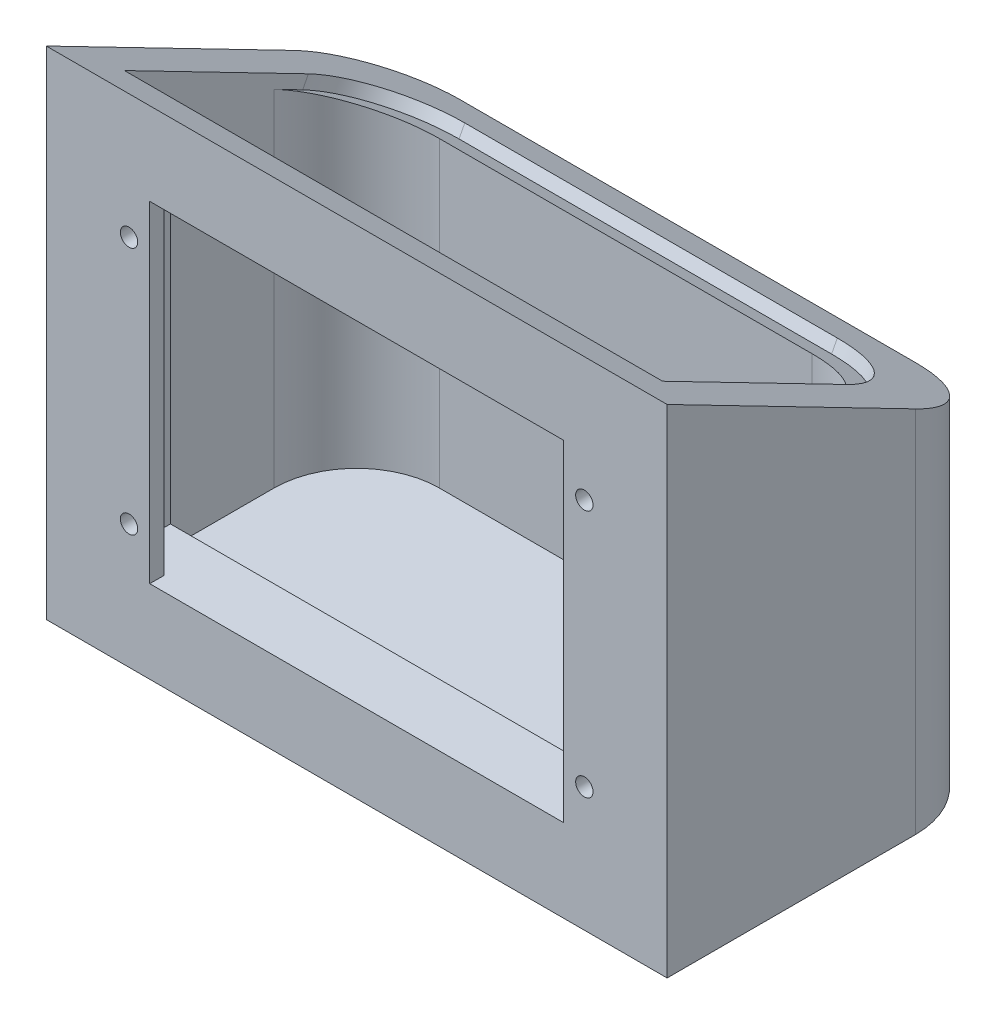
from build123d import *

# Parameters (mm, degrees)
BOSS_EXTRUDE1_DEPTH = 150
CUT_EXTRUDE1_DEPTH  = 3
FILLET1_R           = 20
CUT_EXTRUDE6_REACH  = 220.087
CUT_EXTRUDE6_START  = -10
SKETCH5_W           = 120
SKETCH5_H           = 80
CUT_EXTRUDE7_DEPTH  = 15
SKETCH8_W           = 3.5
SKETCH8_H           = 80
BOSS_EXTRUDE2_DEPTH = 10
SKETCH9_W           = 3.5
SKETCH9_H           = 80
BOSS_EXTRUDE3_DEPTH = 10
SKETCH10_R          = 2.1
CUT_EXTRUDE8_DEPTH  = 3.5


with BuildPart() as part:
    # Sketch1 → Boss-Extrude1 (new body)
    with BuildSketch(Plane(origin=(0, 0, 0), x_dir=(0, 0, -1), z_dir=(1, 0, 0))):
        Polygon((0, 0), (0, 120), (80, 78.768943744), (80, 0), align=None)
    extrude(amount=BOSS_EXTRUDE1_DEPTH)

    # Sketch2 → Cut-Extrude1 (cut)
    with BuildSketch(Plane(origin=(0, 94.814814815, -48.866437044), x_dir=(1, 0, 0), z_dir=(0, 0.8888888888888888, -0.45812284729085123))):
        with BuildLine():
            Line((30, 25.025258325), (120, 25.025258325))
            ThreePointArc((120, 25.025258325), (134.142135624, 19.167393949), (140, 5.025258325))
            Line((140, 5.025258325), (140, -44.974741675))
            Line((140, -44.974741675), (10, -44.974741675))
            Line((10, -44.974741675), (10, 5.025258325))
            ThreePointArc((10, 5.025258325), (15.857864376, 19.167393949), (30, 25.025258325))
        make_face()
    extrude(amount=-CUT_EXTRUDE1_DEPTH, mode=Mode.SUBTRACT)

    # Fillet1
    fillet1_edges = [part.edges().sort_by_distance(p)[0] for p in [
        (0, 39.384471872, -80),
        (150, 39.384471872, -80),
    ]]
    fillet(fillet1_edges, radius=FILLET1_R)

    # Cut-Extrude6: up to this plane
    cut_extrude6_end = Plane(origin=(30, 89.845962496, -51.958964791), z_dir=(0, 0.8888888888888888, -0.45812284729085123))
    # Sketch4 → Cut-Extrude6 (cut, up to the surface)
    with BuildSketch(Plane.XZ.offset(CUT_EXTRUDE6_START), mode=Mode.PRIVATE) as cut_extrude6_sk1:
        with BuildLine():
            Line((140, -15), (140, -45))
            ThreePointArc((140, -45), (134.142135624, -59.142135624), (120, -65))
            Line((120, -65), (30, -65))
            ThreePointArc((30, -65), (15.857864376, -59.142135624), (10, -45))
            Line((10, -45), (10, -15))
            Line((10, -15), (140, -15))
        make_face()
    cut_extrude6_tool1 = split(extrude(cut_extrude6_sk1.sketch, amount=-CUT_EXTRUDE6_REACH, mode=Mode.PRIVATE), bisect_by=cut_extrude6_end, keep=Keep.BOTH, mode=Mode.PRIVATE)
    add(cut_extrude6_tool1.solids().sort_by_distance((75, 10, -39.442968))[0], mode=Mode.SUBTRACT)

    # Sketch5 → Cut-Extrude7 (cut)
    with BuildSketch(Plane.XY):
        with Locations((75, 60)):
            Rectangle(SKETCH5_W, SKETCH5_H)
    extrude(amount=-CUT_EXTRUDE7_DEPTH, mode=Mode.SUBTRACT)

    # Sketch8 → Boss-Extrude2 (add)
    with BuildSketch(Plane(origin=(15, 0, 0), x_dir=(0, 0, -1), z_dir=(1, 0, 0))):
        with Locations((1.75, 60)):
            Rectangle(SKETCH8_W, SKETCH8_H)
    extrude(amount=BOSS_EXTRUDE2_DEPTH)

    # Sketch9 → Boss-Extrude3 (add)
    with BuildSketch(Plane.ZY.offset(-135)):
        with Locations((-1.75, 60)):
            Rectangle(SKETCH9_W, SKETCH9_H)
    extrude(amount=BOSS_EXTRUDE3_DEPTH)

    # Sketch10 → Cut-Extrude8 (cut)
    with BuildSketch(Plane.XY):
        with Locations((130, 90)):
            Circle(SKETCH10_R)
        with Locations((130, 30)):
            Circle(SKETCH10_R)
        with Locations(Location((20, 30, 0), (0, 0, 90))):
            Circle(SKETCH10_R)
        with Locations(Location((20, 90, 0), (0, 0, 90))):
            Circle(SKETCH10_R)
    extrude(amount=-CUT_EXTRUDE8_DEPTH, mode=Mode.SUBTRACT)


solid = part.part
